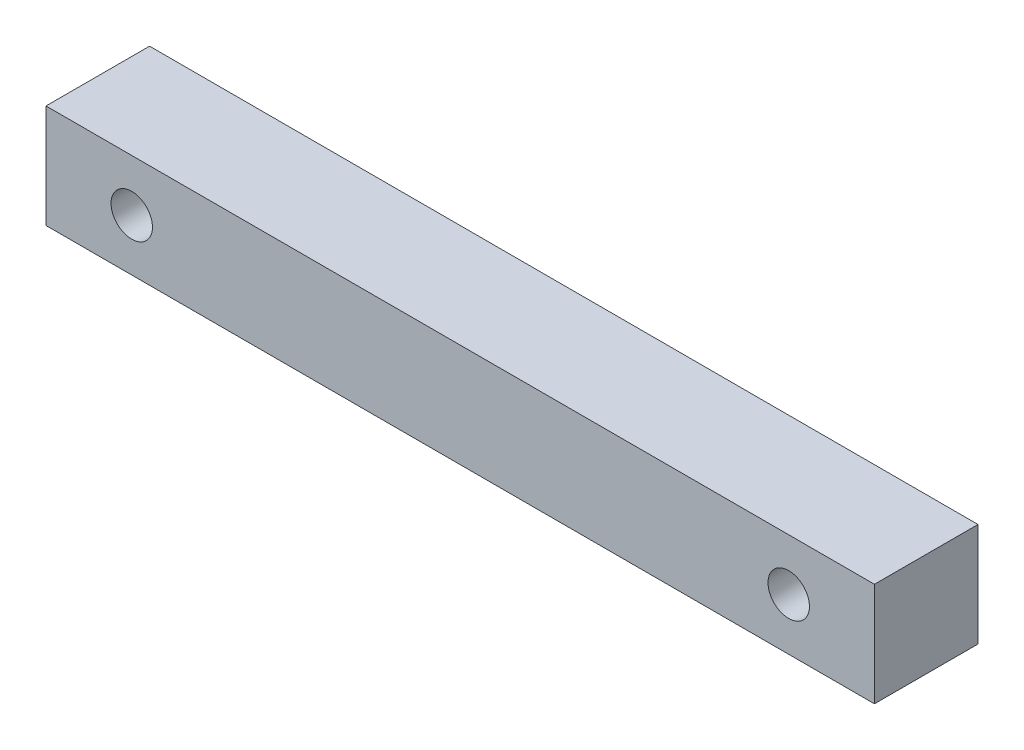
from build123d import *

# Parameters (mm, degrees)
SKETCH1_W           = 40
SKETCH1_H           = 5
BOSS_EXTRUDE1_DEPTH = 5
SKETCH2_R           = 1
CUT_EXTRUDE1_DEPTH  = 5


with BuildPart() as part:
    # Sketch1 → Boss-Extrude1 (new body)
    with BuildSketch(Plane.XY):
        Rectangle(SKETCH1_W, SKETCH1_H)
    extrude(amount=BOSS_EXTRUDE1_DEPTH)

    # Sketch2 → Cut-Extrude1 (cut)
    with BuildSketch(Plane.XY.offset(5)):
        with Locations((-15.86034517, 0)):
            Circle(SKETCH2_R)
        with Locations((15.86034517, 0)):
            Circle(SKETCH2_R)
    extrude(amount=-CUT_EXTRUDE1_DEPTH, mode=Mode.SUBTRACT)


solid = part.part
